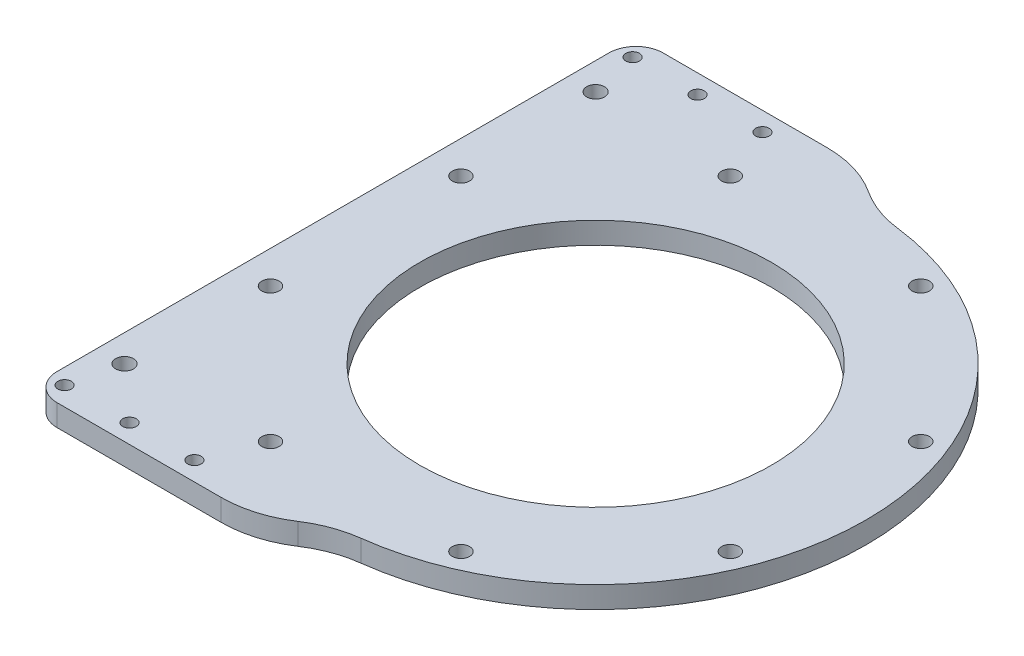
ISO-10303-21;
HEADER;
FILE_DESCRIPTION(('STEP AP214'),'2;1');
FILE_NAME('part.step','',(''),(''),'','','');
FILE_SCHEMA(('AUTOMOTIVE_DESIGN { 1 0 10303 214 1 1 1 1 }'));
ENDSEC;
DATA;
#1=APPLICATION_CONTEXT('core data for automotive mechanical design processes');
#2=APPLICATION_PROTOCOL_DEFINITION('international standard','automotive_design',2000,#1);
#3=PRODUCT_CONTEXT('',#1,'mechanical');
#4=PRODUCT('Part','Part','',(#3));
#5=PRODUCT_RELATED_PRODUCT_CATEGORY('part','',(#4));
#6=PRODUCT_DEFINITION_FORMATION('','',#4);
#7=PRODUCT_DEFINITION_CONTEXT('part definition',#1,'design');
#8=PRODUCT_DEFINITION('design','',#6,#7);
#9=PRODUCT_DEFINITION_SHAPE('','',#8);
#10=(LENGTH_UNIT() NAMED_UNIT(*) SI_UNIT(.MILLI.,.METRE.));
#11=(NAMED_UNIT(*) PLANE_ANGLE_UNIT() SI_UNIT($,.RADIAN.));
#12=(NAMED_UNIT(*) SI_UNIT($,.STERADIAN.) SOLID_ANGLE_UNIT());
#13=UNCERTAINTY_MEASURE_WITH_UNIT(LENGTH_MEASURE(1.E-05),#10,'distance_accuracy_value','');
#14=(GEOMETRIC_REPRESENTATION_CONTEXT(3) GLOBAL_UNCERTAINTY_ASSIGNED_CONTEXT((#13)) GLOBAL_UNIT_ASSIGNED_CONTEXT((#10,
#11,#12)) REPRESENTATION_CONTEXT('',''));
#15=CARTESIAN_POINT('',(0.,0.,0.));
#16=DIRECTION('',(0.,0.,1.));
#17=DIRECTION('',(1.,0.,0.));
#18=AXIS2_PLACEMENT_3D('',#15,#16,#17);
#19=CARTESIAN_POINT('',(-100.,3.,56.));
#20=DIRECTION('',(0.,0.,1.));
#21=DIRECTION('',(1.,0.,0.));
#22=AXIS2_PLACEMENT_3D('',#19,#20,#21);
#23=PLANE('',#22);
#24=DIRECTION('',(1.,0.,0.));
#25=VECTOR('',#24,1.);
#26=CARTESIAN_POINT('',(-100.,3.,56.));
#27=LINE('',#26,#25);
#28=CARTESIAN_POINT('',(113.400785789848,3.,56.));
#29=VERTEX_POINT('',#28);
#30=CARTESIAN_POINT('',(143.705644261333,3.,56.));
#31=VERTEX_POINT('',#30);
#32=EDGE_CURVE('E126',#29,#31,#27,.T.);
#33=ORIENTED_EDGE('',*,*,#32,.F.);
#34=DIRECTION('',(0.,1.,0.));
#35=VECTOR('',#34,1.);
#36=CARTESIAN_POINT('',(113.400785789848,-1.,56.));
#37=LINE('',#36,#35);
#38=CARTESIAN_POINT('',(113.400785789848,-1.,56.));
#39=VERTEX_POINT('',#38);
#40=EDGE_CURVE('E70',#29,#39,#37,.F.);
#41=ORIENTED_EDGE('',*,*,#40,.T.);
#42=DIRECTION('',(1.,0.,0.));
#43=VECTOR('',#42,1.);
#44=CARTESIAN_POINT('',(0.,-1.,56.));
#45=LINE('',#44,#43);
#46=CARTESIAN_POINT('',(143.705644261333,-1.,56.));
#47=VERTEX_POINT('',#46);
#48=EDGE_CURVE('E140',#39,#47,#45,.T.);
#49=ORIENTED_EDGE('',*,*,#48,.T.);
#50=DIRECTION('',(0.,1.,0.));
#51=VECTOR('',#50,1.);
#52=CARTESIAN_POINT('',(143.705644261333,3.,56.));
#53=LINE('',#52,#51);
#54=EDGE_CURVE('E139',#47,#31,#53,.T.);
#55=ORIENTED_EDGE('',*,*,#54,.T.);
#56=EDGE_LOOP('',(#33,#41,#49,#55));
#57=FACE_BOUND('',#56,.T.);
#58=ADVANCED_FACE('F47',(#57),#23,.T.);
#59=CARTESIAN_POINT('',(143.705644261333,3.,36.));
#60=DIRECTION('',(0.,1.,0.));
#61=DIRECTION('',(0.,0.,1.));
#62=AXIS2_PLACEMENT_3D('',#59,#60,#61);
#63=CYLINDRICAL_SURFACE('',#62,20.);
#64=ORIENTED_EDGE('',*,*,#54,.F.);
#65=CARTESIAN_POINT('',(143.705644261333,-1.,36.));
#66=DIRECTION('',(0.,1.,0.));
#67=DIRECTION('',(0.,0.,1.));
#68=AXIS2_PLACEMENT_3D('',#65,#66,#67);
#69=CIRCLE('',#68,20.);
#70=CARTESIAN_POINT('',(154.665979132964,-1.,52.7293472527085));
#71=VERTEX_POINT('',#70);
#72=EDGE_CURVE('E233',#47,#71,#69,.T.);
#73=ORIENTED_EDGE('',*,*,#72,.T.);
#74=DIRECTION('',(0.,1.,0.));
#75=VECTOR('',#74,1.);
#76=CARTESIAN_POINT('',(154.665979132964,3.,52.7293472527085));
#77=LINE('',#76,#75);
#78=CARTESIAN_POINT('',(154.665979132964,3.,52.7293472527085));
#79=VERTEX_POINT('',#78);
#80=EDGE_CURVE('E145',#71,#79,#77,.T.);
#81=ORIENTED_EDGE('',*,*,#80,.T.);
#82=CARTESIAN_POINT('',(143.705644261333,3.,36.));
#83=DIRECTION('',(0.,1.,0.));
#84=DIRECTION('',(0.,0.,1.));
#85=AXIS2_PLACEMENT_3D('',#82,#83,#84);
#86=CIRCLE('',#85,20.);
#87=EDGE_CURVE('E133',#31,#79,#86,.T.);
#88=ORIENTED_EDGE('',*,*,#87,.F.);
#89=EDGE_LOOP('',(#64,#73,#81,#88));
#90=FACE_BOUND('',#89,.T.);
#91=ADVANCED_FACE('F147',(#90),#63,.T.);
#92=CARTESIAN_POINT('',(165.626314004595,3.,69.458694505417));
#93=DIRECTION('',(0.,1.,0.));
#94=DIRECTION('',(0.,0.,1.));
#95=AXIS2_PLACEMENT_3D('',#92,#93,#94);
#96=CYLINDRICAL_SURFACE('',#95,20.);
#97=ORIENTED_EDGE('',*,*,#80,.F.);
#98=CARTESIAN_POINT('',(165.626314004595,-1.,69.458694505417));
#99=DIRECTION('',(0.,1.,0.));
#100=DIRECTION('',(0.,0.,1.));
#101=AXIS2_PLACEMENT_3D('',#98,#99,#100);
#102=CIRCLE('',#101,20.);
#103=CARTESIAN_POINT('',(163.14388994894,-1.,49.613353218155));
#104=VERTEX_POINT('',#103);
#105=EDGE_CURVE('E230',#71,#104,#102,.F.);
#106=ORIENTED_EDGE('',*,*,#105,.T.);
#107=DIRECTION('',(0.,1.,0.));
#108=VECTOR('',#107,1.);
#109=CARTESIAN_POINT('',(163.14388994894,3.,49.613353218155));
#110=LINE('',#109,#108);
#111=CARTESIAN_POINT('',(163.14388994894,3.,49.613353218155));
#112=VERTEX_POINT('',#111);
#113=EDGE_CURVE('E241',#104,#112,#110,.T.);
#114=ORIENTED_EDGE('',*,*,#113,.T.);
#115=CARTESIAN_POINT('',(165.626314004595,3.,69.458694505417));
#116=DIRECTION('',(0.,1.,0.));
#117=DIRECTION('',(0.,0.,1.));
#118=AXIS2_PLACEMENT_3D('',#115,#116,#117);
#119=CIRCLE('',#118,20.);
#120=EDGE_CURVE('E148',#79,#112,#119,.F.);
#121=ORIENTED_EDGE('',*,*,#120,.F.);
#122=EDGE_LOOP('',(#97,#106,#114,#121));
#123=FACE_BOUND('',#122,.T.);
#124=ADVANCED_FACE('F278',(#123),#96,.F.);
#125=CARTESIAN_POINT('',(156.937829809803,3.,0.));
#126=DIRECTION('',(0.,1.,0.));
#127=DIRECTION('',(0.,0.,1.));
#128=AXIS2_PLACEMENT_3D('',#125,#126,#127);
#129=CYLINDRICAL_SURFACE('',#128,50.);
#130=ORIENTED_EDGE('',*,*,#113,.F.);
#131=CARTESIAN_POINT('',(156.937829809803,-1.,0.));
#132=DIRECTION('',(0.,1.,0.));
#133=DIRECTION('',(0.,0.,1.));
#134=AXIS2_PLACEMENT_3D('',#131,#132,#133);
#135=CIRCLE('',#134,50.);
#136=CARTESIAN_POINT('',(163.14388994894,-1.,-49.613353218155));
#137=VERTEX_POINT('',#136);
#138=EDGE_CURVE('E227',#104,#137,#135,.T.);
#139=ORIENTED_EDGE('',*,*,#138,.T.);
#140=DIRECTION('',(0.,1.,0.));
#141=VECTOR('',#140,1.);
#142=CARTESIAN_POINT('',(163.14388994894,3.,-49.613353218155));
#143=LINE('',#142,#141);
#144=CARTESIAN_POINT('',(163.14388994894,3.,-49.613353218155));
#145=VERTEX_POINT('',#144);
#146=EDGE_CURVE('E239',#137,#145,#143,.T.);
#147=ORIENTED_EDGE('',*,*,#146,.T.);
#148=CARTESIAN_POINT('',(156.937829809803,3.,0.));
#149=DIRECTION('',(0.,1.,0.));
#150=DIRECTION('',(0.,0.,1.));
#151=AXIS2_PLACEMENT_3D('',#148,#149,#150);
#152=CIRCLE('',#151,50.);
#153=EDGE_CURVE('E150',#112,#145,#152,.T.);
#154=ORIENTED_EDGE('',*,*,#153,.F.);
#155=EDGE_LOOP('',(#130,#139,#147,#154));
#156=FACE_BOUND('',#155,.T.);
#157=ADVANCED_FACE('F283',(#156),#129,.T.);
#158=CARTESIAN_POINT('',(165.626314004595,3.,-69.458694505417));
#159=DIRECTION('',(0.,1.,0.));
#160=DIRECTION('',(0.,0.,1.));
#161=AXIS2_PLACEMENT_3D('',#158,#159,#160);
#162=CYLINDRICAL_SURFACE('',#161,20.);
#163=ORIENTED_EDGE('',*,*,#146,.F.);
#164=CARTESIAN_POINT('',(165.626314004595,-1.,-69.458694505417));
#165=DIRECTION('',(0.,1.,0.));
#166=DIRECTION('',(0.,0.,1.));
#167=AXIS2_PLACEMENT_3D('',#164,#165,#166);
#168=CIRCLE('',#167,20.);
#169=CARTESIAN_POINT('',(154.665979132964,-1.,-52.7293472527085));
#170=VERTEX_POINT('',#169);
#171=EDGE_CURVE('E224',#137,#170,#168,.F.);
#172=ORIENTED_EDGE('',*,*,#171,.T.);
#173=DIRECTION('',(0.,1.,0.));
#174=VECTOR('',#173,1.);
#175=CARTESIAN_POINT('',(154.665979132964,3.,-52.7293472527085));
#176=LINE('',#175,#174);
#177=CARTESIAN_POINT('',(154.665979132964,3.,-52.7293472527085));
#178=VERTEX_POINT('',#177);
#179=EDGE_CURVE('E237',#170,#178,#176,.T.);
#180=ORIENTED_EDGE('',*,*,#179,.T.);
#181=CARTESIAN_POINT('',(165.626314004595,3.,-69.458694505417));
#182=DIRECTION('',(0.,1.,0.));
#183=DIRECTION('',(0.,0.,1.));
#184=AXIS2_PLACEMENT_3D('',#181,#182,#183);
#185=CIRCLE('',#184,20.);
#186=EDGE_CURVE('E156',#145,#178,#185,.F.);
#187=ORIENTED_EDGE('',*,*,#186,.F.);
#188=EDGE_LOOP('',(#163,#172,#180,#187));
#189=FACE_BOUND('',#188,.T.);
#190=ADVANCED_FACE('F287',(#189),#162,.F.);
#191=CARTESIAN_POINT('',(143.705644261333,3.,-36.));
#192=DIRECTION('',(0.,1.,0.));
#193=DIRECTION('',(0.,0.,1.));
#194=AXIS2_PLACEMENT_3D('',#191,#192,#193);
#195=CYLINDRICAL_SURFACE('',#194,20.);
#196=ORIENTED_EDGE('',*,*,#179,.F.);
#197=CARTESIAN_POINT('',(143.705644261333,-1.,-36.));
#198=DIRECTION('',(0.,1.,0.));
#199=DIRECTION('',(0.,0.,1.));
#200=AXIS2_PLACEMENT_3D('',#197,#198,#199);
#201=CIRCLE('',#200,20.);
#202=CARTESIAN_POINT('',(143.705644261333,-1.,-56.));
#203=VERTEX_POINT('',#202);
#204=EDGE_CURVE('E221',#170,#203,#201,.T.);
#205=ORIENTED_EDGE('',*,*,#204,.T.);
#206=DIRECTION('',(0.,1.,0.));
#207=VECTOR('',#206,1.);
#208=CARTESIAN_POINT('',(143.705644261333,3.,-56.));
#209=LINE('',#208,#207);
#210=CARTESIAN_POINT('',(143.705644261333,3.,-56.));
#211=VERTEX_POINT('',#210);
#212=EDGE_CURVE('E165',#203,#211,#209,.T.);
#213=ORIENTED_EDGE('',*,*,#212,.T.);
#214=CARTESIAN_POINT('',(143.705644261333,3.,-36.));
#215=DIRECTION('',(0.,1.,0.));
#216=DIRECTION('',(0.,0.,1.));
#217=AXIS2_PLACEMENT_3D('',#214,#215,#216);
#218=CIRCLE('',#217,20.);
#219=EDGE_CURVE('E159',#178,#211,#218,.T.);
#220=ORIENTED_EDGE('',*,*,#219,.F.);
#221=EDGE_LOOP('',(#196,#205,#213,#220));
#222=FACE_BOUND('',#221,.T.);
#223=ADVANCED_FACE('F291',(#222),#195,.T.);
#224=CARTESIAN_POINT('',(-100.,3.,-56.));
#225=DIRECTION('',(0.,0.,-1.));
#226=DIRECTION('',(-1.,0.,0.));
#227=AXIS2_PLACEMENT_3D('',#224,#225,#226);
#228=PLANE('',#227);
#229=DIRECTION('',(1.,0.,0.));
#230=VECTOR('',#229,1.);
#231=CARTESIAN_POINT('',(0.,-1.,-56.));
#232=LINE('',#231,#230);
#233=CARTESIAN_POINT('',(113.400785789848,-1.,-56.));
#234=VERTEX_POINT('',#233);
#235=EDGE_CURVE('E218',#203,#234,#232,.F.);
#236=ORIENTED_EDGE('',*,*,#235,.T.);
#237=DIRECTION('',(0.,1.,0.));
#238=VECTOR('',#237,1.);
#239=CARTESIAN_POINT('',(113.400785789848,3.,-56.));
#240=LINE('',#239,#238);
#241=CARTESIAN_POINT('',(113.400785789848,3.,-56.));
#242=VERTEX_POINT('',#241);
#243=EDGE_CURVE('E11',#234,#242,#240,.T.);
#244=ORIENTED_EDGE('',*,*,#243,.T.);
#245=DIRECTION('',(-1.,0.,0.));
#246=VECTOR('',#245,1.);
#247=CARTESIAN_POINT('',(-100.,3.,-56.));
#248=LINE('',#247,#246);
#249=EDGE_CURVE('E162',#211,#242,#248,.T.);
#250=ORIENTED_EDGE('',*,*,#249,.F.);
#251=ORIENTED_EDGE('',*,*,#212,.F.);
#252=EDGE_LOOP('',(#236,#244,#250,#251));
#253=FACE_BOUND('',#252,.T.);
#254=ADVANCED_FACE('F295',(#253),#228,.T.);
#255=CARTESIAN_POINT('',(135.277829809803,3.,52.5));
#256=DIRECTION('',(0.,1.,0.));
#257=DIRECTION('',(0.,0.,1.));
#258=AXIS2_PLACEMENT_3D('',#255,#256,#257);
#259=CYLINDRICAL_SURFACE('',#258,1.25000000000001);
#260=CARTESIAN_POINT('',(135.277829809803,3.,52.5));
#261=DIRECTION('',(0.,1.,0.));
#262=DIRECTION('',(0.,0.,1.));
#263=AXIS2_PLACEMENT_3D('',#260,#261,#262);
#264=CIRCLE('',#263,1.25000000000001);
#265=CARTESIAN_POINT('',(135.277829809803,3.,53.75));
#266=VERTEX_POINT('',#265);
#267=EDGE_CURVE('E220',#266,#266,#264,.F.);
#268=ORIENTED_EDGE('',*,*,#267,.F.);
#269=EDGE_LOOP('',(#268));
#270=FACE_BOUND('',#269,.T.);
#271=CARTESIAN_POINT('',(135.277829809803,-1.,52.5));
#272=DIRECTION('',(0.,1.,0.));
#273=DIRECTION('',(0.,0.,1.));
#274=AXIS2_PLACEMENT_3D('',#271,#272,#273);
#275=CIRCLE('',#274,1.25000000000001);
#276=CARTESIAN_POINT('',(135.277829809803,-1.,53.75));
#277=VERTEX_POINT('',#276);
#278=EDGE_CURVE('E166',#277,#277,#275,.F.);
#279=ORIENTED_EDGE('',*,*,#278,.T.);
#280=EDGE_LOOP('',(#279));
#281=FACE_BOUND('',#280,.T.);
#282=ADVANCED_FACE('F298',(#270,#281),#259,.F.);
#283=CARTESIAN_POINT('',(123.277829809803,3.,52.4999999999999));
#284=DIRECTION('',(0.,1.,0.));
#285=DIRECTION('',(0.,0.,1.));
#286=AXIS2_PLACEMENT_3D('',#283,#284,#285);
#287=CYLINDRICAL_SURFACE('',#286,1.25);
#288=CARTESIAN_POINT('',(123.277829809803,3.,52.4999999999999));
#289=DIRECTION('',(0.,1.,0.));
#290=DIRECTION('',(0.,0.,1.));
#291=AXIS2_PLACEMENT_3D('',#288,#289,#290);
#292=CIRCLE('',#291,1.25);
#293=CARTESIAN_POINT('',(123.277829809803,3.,53.7499999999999));
#294=VERTEX_POINT('',#293);
#295=EDGE_CURVE('E718',#294,#294,#292,.F.);
#296=ORIENTED_EDGE('',*,*,#295,.F.);
#297=EDGE_LOOP('',(#296));
#298=FACE_BOUND('',#297,.T.);
#299=CARTESIAN_POINT('',(123.277829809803,-1.,52.4999999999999));
#300=DIRECTION('',(0.,1.,0.));
#301=DIRECTION('',(0.,0.,1.));
#302=AXIS2_PLACEMENT_3D('',#299,#300,#301);
#303=CIRCLE('',#302,1.25);
#304=CARTESIAN_POINT('',(123.277829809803,-1.,53.7499999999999));
#305=VERTEX_POINT('',#304);
#306=EDGE_CURVE('E169',#305,#305,#303,.F.);
#307=ORIENTED_EDGE('',*,*,#306,.T.);
#308=EDGE_LOOP('',(#307));
#309=FACE_BOUND('',#308,.T.);
#310=ADVANCED_FACE('F358',(#298,#309),#287,.F.);
#311=CARTESIAN_POINT('',(111.277829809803,3.,52.4999999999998));
#312=DIRECTION('',(0.,1.,0.));
#313=DIRECTION('',(0.,0.,1.));
#314=AXIS2_PLACEMENT_3D('',#311,#312,#313);
#315=CYLINDRICAL_SURFACE('',#314,1.25);
#316=CARTESIAN_POINT('',(111.277829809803,3.,52.4999999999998));
#317=DIRECTION('',(0.,1.,0.));
#318=DIRECTION('',(0.,0.,1.));
#319=AXIS2_PLACEMENT_3D('',#316,#317,#318);
#320=CIRCLE('',#319,1.25);
#321=CARTESIAN_POINT('',(111.277829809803,3.,53.7499999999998));
#322=VERTEX_POINT('',#321);
#323=EDGE_CURVE('E721',#322,#322,#320,.F.);
#324=ORIENTED_EDGE('',*,*,#323,.F.);
#325=EDGE_LOOP('',(#324));
#326=FACE_BOUND('',#325,.T.);
#327=CARTESIAN_POINT('',(111.277829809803,-1.,52.4999999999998));
#328=DIRECTION('',(0.,1.,0.));
#329=DIRECTION('',(0.,0.,1.));
#330=AXIS2_PLACEMENT_3D('',#327,#328,#329);
#331=CIRCLE('',#330,1.25);
#332=CARTESIAN_POINT('',(111.277829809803,-1.,53.7499999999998));
#333=VERTEX_POINT('',#332);
#334=EDGE_CURVE('E173',#333,#333,#331,.F.);
#335=ORIENTED_EDGE('',*,*,#334,.T.);
#336=EDGE_LOOP('',(#335));
#337=FACE_BOUND('',#336,.T.);
#338=ADVANCED_FACE('F354',(#326,#337),#315,.F.);
#339=CARTESIAN_POINT('',(156.937829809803,3.,0.));
#340=DIRECTION('',(0.,1.,0.));
#341=DIRECTION('',(0.,0.,1.));
#342=AXIS2_PLACEMENT_3D('',#339,#340,#341);
#343=CYLINDRICAL_SURFACE('',#342,32.5);
#344=CARTESIAN_POINT('',(156.937829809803,3.,0.));
#345=DIRECTION('',(0.,1.,0.));
#346=DIRECTION('',(0.,0.,1.));
#347=AXIS2_PLACEMENT_3D('',#344,#345,#346);
#348=CIRCLE('',#347,32.5);
#349=CARTESIAN_POINT('',(156.937829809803,3.,32.5));
#350=VERTEX_POINT('',#349);
#351=EDGE_CURVE('E727',#350,#350,#348,.T.);
#352=ORIENTED_EDGE('',*,*,#351,.T.);
#353=EDGE_LOOP('',(#352));
#354=FACE_BOUND('',#353,.T.);
#355=CARTESIAN_POINT('',(156.937829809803,-1.,0.));
#356=DIRECTION('',(0.,1.,0.));
#357=DIRECTION('',(0.,0.,1.));
#358=AXIS2_PLACEMENT_3D('',#355,#356,#357);
#359=CIRCLE('',#358,32.5);
#360=CARTESIAN_POINT('',(156.937829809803,-1.,32.5));
#361=VERTEX_POINT('',#360);
#362=EDGE_CURVE('E176',#361,#361,#359,.T.);
#363=ORIENTED_EDGE('',*,*,#362,.F.);
#364=EDGE_LOOP('',(#363));
#365=FACE_BOUND('',#364,.T.);
#366=ADVANCED_FACE('F350',(#354,#365),#343,.F.);
#367=CARTESIAN_POINT('',(113.400785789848,3.,43.5370440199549));
#368=DIRECTION('',(0.,1.,0.));
#369=DIRECTION('',(0.,0.,1.));
#370=AXIS2_PLACEMENT_3D('',#367,#368,#369);
#371=CYLINDRICAL_SURFACE('',#370,1.65);
#372=CARTESIAN_POINT('',(113.400785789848,3.,43.5370440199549));
#373=DIRECTION('',(0.,1.,0.));
#374=DIRECTION('',(0.,0.,1.));
#375=AXIS2_PLACEMENT_3D('',#372,#373,#374);
#376=CIRCLE('',#375,1.65);
#377=CARTESIAN_POINT('',(113.400785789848,3.,45.1870440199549));
#378=VERTEX_POINT('',#377);
#379=EDGE_CURVE('E730',#378,#378,#376,.F.);
#380=ORIENTED_EDGE('',*,*,#379,.F.);
#381=EDGE_LOOP('',(#380));
#382=FACE_BOUND('',#381,.T.);
#383=CARTESIAN_POINT('',(113.400785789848,-1.,43.5370440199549));
#384=DIRECTION('',(0.,1.,0.));
#385=DIRECTION('',(0.,0.,1.));
#386=AXIS2_PLACEMENT_3D('',#383,#384,#385);
#387=CIRCLE('',#386,1.65);
#388=CARTESIAN_POINT('',(113.400785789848,-1.,45.1870440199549));
#389=VERTEX_POINT('',#388);
#390=EDGE_CURVE('E179',#389,#389,#387,.F.);
#391=ORIENTED_EDGE('',*,*,#390,.T.);
#392=EDGE_LOOP('',(#391));
#393=FACE_BOUND('',#392,.T.);
#394=ADVANCED_FACE('F346',(#382,#393),#371,.F.);
#395=CARTESIAN_POINT('',(139.335954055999,3.,42.4991055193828));
#396=DIRECTION('',(0.,1.,0.));
#397=DIRECTION('',(0.,0.,1.));
#398=AXIS2_PLACEMENT_3D('',#395,#396,#397);
#399=CYLINDRICAL_SURFACE('',#398,1.59999999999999);
#400=CARTESIAN_POINT('',(139.335954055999,3.,42.4991055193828));
#401=DIRECTION('',(0.,1.,0.));
#402=DIRECTION('',(0.,0.,1.));
#403=AXIS2_PLACEMENT_3D('',#400,#401,#402);
#404=CIRCLE('',#403,1.59999999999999);
#405=CARTESIAN_POINT('',(139.335954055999,3.,44.0991055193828));
#406=VERTEX_POINT('',#405);
#407=EDGE_CURVE('E733',#406,#406,#404,.T.);
#408=ORIENTED_EDGE('',*,*,#407,.T.);
#409=EDGE_LOOP('',(#408));
#410=FACE_BOUND('',#409,.T.);
#411=CARTESIAN_POINT('',(139.335954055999,-1.,42.4991055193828));
#412=DIRECTION('',(0.,1.,0.));
#413=DIRECTION('',(0.,0.,1.));
#414=AXIS2_PLACEMENT_3D('',#411,#412,#413);
#415=CIRCLE('',#414,1.59999999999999);
#416=CARTESIAN_POINT('',(139.335954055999,-1.,44.0991055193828));
#417=VERTEX_POINT('',#416);
#418=EDGE_CURVE('E182',#417,#417,#415,.T.);
#419=ORIENTED_EDGE('',*,*,#418,.F.);
#420=EDGE_LOOP('',(#419));
#421=FACE_BOUND('',#420,.T.);
#422=ADVANCED_FACE('F342',(#410,#421),#399,.F.);
#423=CARTESIAN_POINT('',(174.539705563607,3.,-42.4991055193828));
#424=DIRECTION('',(0.,1.,0.));
#425=DIRECTION('',(0.,0.,1.));
#426=AXIS2_PLACEMENT_3D('',#423,#424,#425);
#427=CYLINDRICAL_SURFACE('',#426,1.59999999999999);
#428=CARTESIAN_POINT('',(174.539705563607,3.,-42.4991055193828));
#429=DIRECTION('',(0.,1.,0.));
#430=DIRECTION('',(0.,0.,1.));
#431=AXIS2_PLACEMENT_3D('',#428,#429,#430);
#432=CIRCLE('',#431,1.59999999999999);
#433=CARTESIAN_POINT('',(174.539705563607,3.,-40.8991055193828));
#434=VERTEX_POINT('',#433);
#435=EDGE_CURVE('E736',#434,#434,#432,.T.);
#436=ORIENTED_EDGE('',*,*,#435,.T.);
#437=EDGE_LOOP('',(#436));
#438=FACE_BOUND('',#437,.T.);
#439=CARTESIAN_POINT('',(174.539705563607,-1.,-42.4991055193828));
#440=DIRECTION('',(0.,1.,0.));
#441=DIRECTION('',(0.,0.,1.));
#442=AXIS2_PLACEMENT_3D('',#439,#440,#441);
#443=CIRCLE('',#442,1.59999999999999);
#444=CARTESIAN_POINT('',(174.539705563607,-1.,-40.8991055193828));
#445=VERTEX_POINT('',#444);
#446=EDGE_CURVE('E185',#445,#445,#443,.T.);
#447=ORIENTED_EDGE('',*,*,#446,.F.);
#448=EDGE_LOOP('',(#447));
#449=FACE_BOUND('',#448,.T.);
#450=ADVANCED_FACE('F338',(#438,#449),#427,.F.);
#451=CARTESIAN_POINT('',(139.332829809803,3.,-42.4978114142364));
#452=DIRECTION('',(0.,1.,0.));
#453=DIRECTION('',(0.,0.,1.));
#454=AXIS2_PLACEMENT_3D('',#451,#452,#453);
#455=CYLINDRICAL_SURFACE('',#454,1.59999999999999);
#456=CARTESIAN_POINT('',(139.332829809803,3.,-42.4978114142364));
#457=DIRECTION('',(0.,1.,0.));
#458=DIRECTION('',(0.,0.,1.));
#459=AXIS2_PLACEMENT_3D('',#456,#457,#458);
#460=CIRCLE('',#459,1.59999999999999);
#461=CARTESIAN_POINT('',(139.332829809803,3.,-40.8978114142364));
#462=VERTEX_POINT('',#461);
#463=EDGE_CURVE('E739',#462,#462,#460,.T.);
#464=ORIENTED_EDGE('',*,*,#463,.T.);
#465=EDGE_LOOP('',(#464));
#466=FACE_BOUND('',#465,.T.);
#467=CARTESIAN_POINT('',(139.332829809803,-1.,-42.4978114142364));
#468=DIRECTION('',(0.,1.,0.));
#469=DIRECTION('',(0.,0.,1.));
#470=AXIS2_PLACEMENT_3D('',#467,#468,#469);
#471=CIRCLE('',#470,1.59999999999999);
#472=CARTESIAN_POINT('',(139.332829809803,-1.,-40.8978114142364));
#473=VERTEX_POINT('',#472);
#474=EDGE_CURVE('E188',#473,#473,#471,.T.);
#475=ORIENTED_EDGE('',*,*,#474,.F.);
#476=EDGE_LOOP('',(#475));
#477=FACE_BOUND('',#476,.T.);
#478=ADVANCED_FACE('F334',(#466,#477),#455,.F.);
#479=CARTESIAN_POINT('',(114.43872429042,3.,-17.6018757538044));
#480=DIRECTION('',(0.,1.,0.));
#481=DIRECTION('',(0.,0.,1.));
#482=AXIS2_PLACEMENT_3D('',#479,#480,#481);
#483=CYLINDRICAL_SURFACE('',#482,1.6);
#484=CARTESIAN_POINT('',(114.43872429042,3.,-17.6018757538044));
#485=DIRECTION('',(0.,1.,0.));
#486=DIRECTION('',(0.,0.,1.));
#487=AXIS2_PLACEMENT_3D('',#484,#485,#486);
#488=CIRCLE('',#487,1.6);
#489=CARTESIAN_POINT('',(114.43872429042,3.,-16.0018757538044));
#490=VERTEX_POINT('',#489);
#491=EDGE_CURVE('E742',#490,#490,#488,.T.);
#492=ORIENTED_EDGE('',*,*,#491,.T.);
#493=EDGE_LOOP('',(#492));
#494=FACE_BOUND('',#493,.T.);
#495=CARTESIAN_POINT('',(114.43872429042,-1.,-17.6018757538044));
#496=DIRECTION('',(0.,1.,0.));
#497=DIRECTION('',(0.,0.,1.));
#498=AXIS2_PLACEMENT_3D('',#495,#496,#497);
#499=CIRCLE('',#498,1.6);
#500=CARTESIAN_POINT('',(114.43872429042,-1.,-16.0018757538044));
#501=VERTEX_POINT('',#500);
#502=EDGE_CURVE('E191',#501,#501,#499,.T.);
#503=ORIENTED_EDGE('',*,*,#502,.F.);
#504=EDGE_LOOP('',(#503));
#505=FACE_BOUND('',#504,.T.);
#506=ADVANCED_FACE('F330',(#494,#505),#483,.F.);
#507=CARTESIAN_POINT('',(174.542829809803,3.,42.4978114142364));
#508=DIRECTION('',(0.,1.,0.));
#509=DIRECTION('',(0.,0.,1.));
#510=AXIS2_PLACEMENT_3D('',#507,#508,#509);
#511=CYLINDRICAL_SURFACE('',#510,1.59999999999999);
#512=CARTESIAN_POINT('',(174.542829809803,3.,42.4978114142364));
#513=DIRECTION('',(0.,1.,0.));
#514=DIRECTION('',(0.,0.,1.));
#515=AXIS2_PLACEMENT_3D('',#512,#513,#514);
#516=CIRCLE('',#515,1.59999999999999);
#517=CARTESIAN_POINT('',(174.542829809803,3.,44.0978114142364));
#518=VERTEX_POINT('',#517);
#519=EDGE_CURVE('E745',#518,#518,#516,.T.);
#520=ORIENTED_EDGE('',*,*,#519,.T.);
#521=EDGE_LOOP('',(#520));
#522=FACE_BOUND('',#521,.T.);
#523=CARTESIAN_POINT('',(174.542829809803,-1.,42.4978114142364));
#524=DIRECTION('',(0.,1.,0.));
#525=DIRECTION('',(0.,0.,1.));
#526=AXIS2_PLACEMENT_3D('',#523,#524,#525);
#527=CIRCLE('',#526,1.59999999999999);
#528=CARTESIAN_POINT('',(174.542829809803,-1.,44.0978114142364));
#529=VERTEX_POINT('',#528);
#530=EDGE_CURVE('E194',#529,#529,#527,.T.);
#531=ORIENTED_EDGE('',*,*,#530,.F.);
#532=EDGE_LOOP('',(#531));
#533=FACE_BOUND('',#532,.T.);
#534=ADVANCED_FACE('F326',(#522,#533),#511,.F.);
#535=CARTESIAN_POINT('',(199.436935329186,3.,17.6018757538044));
#536=DIRECTION('',(0.,1.,0.));
#537=DIRECTION('',(0.,0.,1.));
#538=AXIS2_PLACEMENT_3D('',#535,#536,#537);
#539=CYLINDRICAL_SURFACE('',#538,1.59999999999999);
#540=CARTESIAN_POINT('',(199.436935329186,3.,17.6018757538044));
#541=DIRECTION('',(0.,1.,0.));
#542=DIRECTION('',(0.,0.,1.));
#543=AXIS2_PLACEMENT_3D('',#540,#541,#542);
#544=CIRCLE('',#543,1.59999999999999);
#545=CARTESIAN_POINT('',(199.436935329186,3.,19.2018757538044));
#546=VERTEX_POINT('',#545);
#547=EDGE_CURVE('E748',#546,#546,#544,.T.);
#548=ORIENTED_EDGE('',*,*,#547,.T.);
#549=EDGE_LOOP('',(#548));
#550=FACE_BOUND('',#549,.T.);
#551=CARTESIAN_POINT('',(199.436935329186,-1.,17.6018757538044));
#552=DIRECTION('',(0.,1.,0.));
#553=DIRECTION('',(0.,0.,1.));
#554=AXIS2_PLACEMENT_3D('',#551,#552,#553);
#555=CIRCLE('',#554,1.59999999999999);
#556=CARTESIAN_POINT('',(199.436935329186,-1.,19.2018757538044));
#557=VERTEX_POINT('',#556);
#558=EDGE_CURVE('E197',#557,#557,#555,.T.);
#559=ORIENTED_EDGE('',*,*,#558,.F.);
#560=EDGE_LOOP('',(#559));
#561=FACE_BOUND('',#560,.T.);
#562=ADVANCED_FACE('F322',(#550,#561),#539,.F.);
#563=CARTESIAN_POINT('',(199.43564122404,3.,-17.605));
#564=DIRECTION('',(0.,1.,0.));
#565=DIRECTION('',(0.,0.,1.));
#566=AXIS2_PLACEMENT_3D('',#563,#564,#565);
#567=CYLINDRICAL_SURFACE('',#566,1.59999999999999);
#568=CARTESIAN_POINT('',(199.43564122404,3.,-17.605));
#569=DIRECTION('',(0.,1.,0.));
#570=DIRECTION('',(0.,0.,1.));
#571=AXIS2_PLACEMENT_3D('',#568,#569,#570);
#572=CIRCLE('',#571,1.59999999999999);
#573=CARTESIAN_POINT('',(199.43564122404,3.,-16.005));
#574=VERTEX_POINT('',#573);
#575=EDGE_CURVE('E751',#574,#574,#572,.T.);
#576=ORIENTED_EDGE('',*,*,#575,.T.);
#577=EDGE_LOOP('',(#576));
#578=FACE_BOUND('',#577,.T.);
#579=CARTESIAN_POINT('',(199.43564122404,-1.,-17.605));
#580=DIRECTION('',(0.,1.,0.));
#581=DIRECTION('',(0.,0.,1.));
#582=AXIS2_PLACEMENT_3D('',#579,#580,#581);
#583=CIRCLE('',#582,1.59999999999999);
#584=CARTESIAN_POINT('',(199.43564122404,-1.,-16.005));
#585=VERTEX_POINT('',#584);
#586=EDGE_CURVE('E200',#585,#585,#583,.T.);
#587=ORIENTED_EDGE('',*,*,#586,.F.);
#588=EDGE_LOOP('',(#587));
#589=FACE_BOUND('',#588,.T.);
#590=ADVANCED_FACE('F318',(#578,#589),#567,.F.);
#591=CARTESIAN_POINT('',(114.440018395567,3.,17.605));
#592=DIRECTION('',(0.,1.,0.));
#593=DIRECTION('',(0.,0.,1.));
#594=AXIS2_PLACEMENT_3D('',#591,#592,#593);
#595=CYLINDRICAL_SURFACE('',#594,1.60000000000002);
#596=CARTESIAN_POINT('',(114.440018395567,3.,17.605));
#597=DIRECTION('',(0.,1.,0.));
#598=DIRECTION('',(0.,0.,1.));
#599=AXIS2_PLACEMENT_3D('',#596,#597,#598);
#600=CIRCLE('',#599,1.60000000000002);
#601=CARTESIAN_POINT('',(114.440018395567,3.,19.205));
#602=VERTEX_POINT('',#601);
#603=EDGE_CURVE('E754',#602,#602,#600,.T.);
#604=ORIENTED_EDGE('',*,*,#603,.T.);
#605=EDGE_LOOP('',(#604));
#606=FACE_BOUND('',#605,.T.);
#607=CARTESIAN_POINT('',(114.440018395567,-1.,17.605));
#608=DIRECTION('',(0.,1.,0.));
#609=DIRECTION('',(0.,0.,1.));
#610=AXIS2_PLACEMENT_3D('',#607,#608,#609);
#611=CIRCLE('',#610,1.60000000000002);
#612=CARTESIAN_POINT('',(114.440018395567,-1.,19.205));
#613=VERTEX_POINT('',#612);
#614=EDGE_CURVE('E203',#613,#613,#611,.T.);
#615=ORIENTED_EDGE('',*,*,#614,.F.);
#616=EDGE_LOOP('',(#615));
#617=FACE_BOUND('',#616,.T.);
#618=ADVANCED_FACE('F314',(#606,#617),#595,.F.);
#619=CARTESIAN_POINT('',(113.400785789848,3.,-43.5370440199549));
#620=DIRECTION('',(0.,1.,0.));
#621=DIRECTION('',(0.,0.,1.));
#622=AXIS2_PLACEMENT_3D('',#619,#620,#621);
#623=CYLINDRICAL_SURFACE('',#622,1.65);
#624=CARTESIAN_POINT('',(113.400785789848,3.,-43.5370440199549));
#625=DIRECTION('',(0.,1.,0.));
#626=DIRECTION('',(0.,0.,1.));
#627=AXIS2_PLACEMENT_3D('',#624,#625,#626);
#628=CIRCLE('',#627,1.65);
#629=CARTESIAN_POINT('',(113.400785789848,3.,-41.8870440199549));
#630=VERTEX_POINT('',#629);
#631=EDGE_CURVE('E757',#630,#630,#628,.T.);
#632=ORIENTED_EDGE('',*,*,#631,.T.);
#633=EDGE_LOOP('',(#632));
#634=FACE_BOUND('',#633,.T.);
#635=CARTESIAN_POINT('',(113.400785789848,-1.,-43.5370440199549));
#636=DIRECTION('',(0.,1.,0.));
#637=DIRECTION('',(0.,0.,1.));
#638=AXIS2_PLACEMENT_3D('',#635,#636,#637);
#639=CIRCLE('',#638,1.65);
#640=CARTESIAN_POINT('',(113.400785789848,-1.,-41.8870440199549));
#641=VERTEX_POINT('',#640);
#642=EDGE_CURVE('E206',#641,#641,#639,.T.);
#643=ORIENTED_EDGE('',*,*,#642,.F.);
#644=EDGE_LOOP('',(#643));
#645=FACE_BOUND('',#644,.T.);
#646=ADVANCED_FACE('F310',(#634,#645),#623,.F.);
#647=CARTESIAN_POINT('',(111.277829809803,3.,-52.4999999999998));
#648=DIRECTION('',(0.,1.,0.));
#649=DIRECTION('',(0.,0.,1.));
#650=AXIS2_PLACEMENT_3D('',#647,#648,#649);
#651=CYLINDRICAL_SURFACE('',#650,1.25);
#652=CARTESIAN_POINT('',(111.277829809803,3.,-52.4999999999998));
#653=DIRECTION('',(0.,1.,0.));
#654=DIRECTION('',(0.,0.,1.));
#655=AXIS2_PLACEMENT_3D('',#652,#653,#654);
#656=CIRCLE('',#655,1.25);
#657=CARTESIAN_POINT('',(111.277829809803,3.,-51.2499999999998));
#658=VERTEX_POINT('',#657);
#659=EDGE_CURVE('E760',#658,#658,#656,.T.);
#660=ORIENTED_EDGE('',*,*,#659,.T.);
#661=EDGE_LOOP('',(#660));
#662=FACE_BOUND('',#661,.T.);
#663=CARTESIAN_POINT('',(111.277829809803,-1.,-52.4999999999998));
#664=DIRECTION('',(0.,1.,0.));
#665=DIRECTION('',(0.,0.,1.));
#666=AXIS2_PLACEMENT_3D('',#663,#664,#665);
#667=CIRCLE('',#666,1.25);
#668=CARTESIAN_POINT('',(111.277829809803,-1.,-51.2499999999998));
#669=VERTEX_POINT('',#668);
#670=EDGE_CURVE('E209',#669,#669,#667,.T.);
#671=ORIENTED_EDGE('',*,*,#670,.F.);
#672=EDGE_LOOP('',(#671));
#673=FACE_BOUND('',#672,.T.);
#674=ADVANCED_FACE('F306',(#662,#673),#651,.F.);
#675=CARTESIAN_POINT('',(123.277829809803,3.,-52.4999999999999));
#676=DIRECTION('',(0.,1.,0.));
#677=DIRECTION('',(0.,0.,1.));
#678=AXIS2_PLACEMENT_3D('',#675,#676,#677);
#679=CYLINDRICAL_SURFACE('',#678,1.25);
#680=CARTESIAN_POINT('',(123.277829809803,3.,-52.4999999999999));
#681=DIRECTION('',(0.,1.,0.));
#682=DIRECTION('',(0.,0.,1.));
#683=AXIS2_PLACEMENT_3D('',#680,#681,#682);
#684=CIRCLE('',#683,1.25);
#685=CARTESIAN_POINT('',(123.277829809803,3.,-51.2499999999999));
#686=VERTEX_POINT('',#685);
#687=EDGE_CURVE('E763',#686,#686,#684,.T.);
#688=ORIENTED_EDGE('',*,*,#687,.T.);
#689=EDGE_LOOP('',(#688));
#690=FACE_BOUND('',#689,.T.);
#691=CARTESIAN_POINT('',(123.277829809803,-1.,-52.4999999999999));
#692=DIRECTION('',(0.,1.,0.));
#693=DIRECTION('',(0.,0.,1.));
#694=AXIS2_PLACEMENT_3D('',#691,#692,#693);
#695=CIRCLE('',#694,1.25);
#696=CARTESIAN_POINT('',(123.277829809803,-1.,-51.2499999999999));
#697=VERTEX_POINT('',#696);
#698=EDGE_CURVE('E212',#697,#697,#695,.T.);
#699=ORIENTED_EDGE('',*,*,#698,.F.);
#700=EDGE_LOOP('',(#699));
#701=FACE_BOUND('',#700,.T.);
#702=ADVANCED_FACE('F302',(#690,#701),#679,.F.);
#703=CARTESIAN_POINT('',(135.277829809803,3.,-52.5));
#704=DIRECTION('',(0.,1.,0.));
#705=DIRECTION('',(0.,0.,1.));
#706=AXIS2_PLACEMENT_3D('',#703,#704,#705);
#707=CYLINDRICAL_SURFACE('',#706,1.25000000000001);
#708=CARTESIAN_POINT('',(135.277829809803,3.,-52.5));
#709=DIRECTION('',(0.,1.,0.));
#710=DIRECTION('',(0.,0.,1.));
#711=AXIS2_PLACEMENT_3D('',#708,#709,#710);
#712=CIRCLE('',#711,1.25000000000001);
#713=CARTESIAN_POINT('',(135.277829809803,3.,-51.25));
#714=VERTEX_POINT('',#713);
#715=EDGE_CURVE('E136',#714,#714,#712,.T.);
#716=ORIENTED_EDGE('',*,*,#715,.T.);
#717=EDGE_LOOP('',(#716));
#718=FACE_BOUND('',#717,.T.);
#719=CARTESIAN_POINT('',(135.277829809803,-1.,-52.5));
#720=DIRECTION('',(0.,1.,0.));
#721=DIRECTION('',(0.,0.,1.));
#722=AXIS2_PLACEMENT_3D('',#719,#720,#721);
#723=CIRCLE('',#722,1.25000000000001);
#724=CARTESIAN_POINT('',(135.277829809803,-1.,-51.25));
#725=VERTEX_POINT('',#724);
#726=EDGE_CURVE('E215',#725,#725,#723,.T.);
#727=ORIENTED_EDGE('',*,*,#726,.F.);
#728=EDGE_LOOP('',(#727));
#729=FACE_BOUND('',#728,.T.);
#730=ADVANCED_FACE('F300',(#718,#729),#707,.F.);
#731=CARTESIAN_POINT('',(0.,3.,0.));
#732=DIRECTION('',(0.,1.,0.));
#733=DIRECTION('',(0.,0.,1.));
#734=AXIS2_PLACEMENT_3D('',#731,#732,#733);
#735=PLANE('',#734);
#736=DIRECTION('',(0.,0.,-1.));
#737=VECTOR('',#736,1.);
#738=CARTESIAN_POINT('',(108.400785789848,3.,0.));
#739=LINE('',#738,#737);
#740=CARTESIAN_POINT('',(108.400785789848,3.,51.));
#741=VERTEX_POINT('',#740);
#742=CARTESIAN_POINT('',(108.400785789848,3.,-51.));
#743=VERTEX_POINT('',#742);
#744=EDGE_CURVE('E170',#741,#743,#739,.T.);
#745=ORIENTED_EDGE('',*,*,#744,.F.);
#746=CARTESIAN_POINT('',(113.400785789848,3.,51.));
#747=DIRECTION('',(0.,1.,0.));
#748=DIRECTION('',(0.,0.,1.));
#749=AXIS2_PLACEMENT_3D('',#746,#747,#748);
#750=CIRCLE('',#749,5.);
#751=EDGE_CURVE('E135',#741,#29,#750,.T.);
#752=ORIENTED_EDGE('',*,*,#751,.T.);
#753=ORIENTED_EDGE('',*,*,#32,.T.);
#754=ORIENTED_EDGE('',*,*,#87,.T.);
#755=ORIENTED_EDGE('',*,*,#120,.T.);
#756=ORIENTED_EDGE('',*,*,#153,.T.);
#757=ORIENTED_EDGE('',*,*,#186,.T.);
#758=ORIENTED_EDGE('',*,*,#219,.T.);
#759=ORIENTED_EDGE('',*,*,#249,.T.);
#760=CARTESIAN_POINT('',(113.400785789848,3.,-51.));
#761=DIRECTION('',(0.,1.,0.));
#762=DIRECTION('',(0.,0.,1.));
#763=AXIS2_PLACEMENT_3D('',#760,#761,#762);
#764=CIRCLE('',#763,5.);
#765=EDGE_CURVE('E250',#242,#743,#764,.T.);
#766=ORIENTED_EDGE('',*,*,#765,.T.);
#767=EDGE_LOOP('',(#745,#752,#753,#754,#755,#756,#757,#758,#759,#766));
#768=FACE_BOUND('',#767,.T.);
#769=ORIENTED_EDGE('',*,*,#267,.T.);
#770=EDGE_LOOP('',(#769));
#771=FACE_BOUND('',#770,.T.);
#772=ORIENTED_EDGE('',*,*,#295,.T.);
#773=EDGE_LOOP('',(#772));
#774=FACE_BOUND('',#773,.T.);
#775=ORIENTED_EDGE('',*,*,#323,.T.);
#776=EDGE_LOOP('',(#775));
#777=FACE_BOUND('',#776,.T.);
#778=ORIENTED_EDGE('',*,*,#351,.F.);
#779=EDGE_LOOP('',(#778));
#780=FACE_BOUND('',#779,.T.);
#781=ORIENTED_EDGE('',*,*,#379,.T.);
#782=EDGE_LOOP('',(#781));
#783=FACE_BOUND('',#782,.T.);
#784=ORIENTED_EDGE('',*,*,#407,.F.);
#785=EDGE_LOOP('',(#784));
#786=FACE_BOUND('',#785,.T.);
#787=ORIENTED_EDGE('',*,*,#435,.F.);
#788=EDGE_LOOP('',(#787));
#789=FACE_BOUND('',#788,.T.);
#790=ORIENTED_EDGE('',*,*,#463,.F.);
#791=EDGE_LOOP('',(#790));
#792=FACE_BOUND('',#791,.T.);
#793=ORIENTED_EDGE('',*,*,#491,.F.);
#794=EDGE_LOOP('',(#793));
#795=FACE_BOUND('',#794,.T.);
#796=ORIENTED_EDGE('',*,*,#519,.F.);
#797=EDGE_LOOP('',(#796));
#798=FACE_BOUND('',#797,.T.);
#799=ORIENTED_EDGE('',*,*,#547,.F.);
#800=EDGE_LOOP('',(#799));
#801=FACE_BOUND('',#800,.T.);
#802=ORIENTED_EDGE('',*,*,#575,.F.);
#803=EDGE_LOOP('',(#802));
#804=FACE_BOUND('',#803,.T.);
#805=ORIENTED_EDGE('',*,*,#603,.F.);
#806=EDGE_LOOP('',(#805));
#807=FACE_BOUND('',#806,.T.);
#808=ORIENTED_EDGE('',*,*,#631,.F.);
#809=EDGE_LOOP('',(#808));
#810=FACE_BOUND('',#809,.T.);
#811=ORIENTED_EDGE('',*,*,#659,.F.);
#812=EDGE_LOOP('',(#811));
#813=FACE_BOUND('',#812,.T.);
#814=ORIENTED_EDGE('',*,*,#687,.F.);
#815=EDGE_LOOP('',(#814));
#816=FACE_BOUND('',#815,.T.);
#817=ORIENTED_EDGE('',*,*,#715,.F.);
#818=EDGE_LOOP('',(#817));
#819=FACE_BOUND('',#818,.T.);
#820=ADVANCED_FACE('F129',(#768,#771,#774,#777,#780,#783,#786,#789,#792,#795,#798,#801,#804,
#807,#810,#813,#816,#819),#735,.T.);
#821=CARTESIAN_POINT('',(0.,-1.,0.));
#822=DIRECTION('',(0.,1.,0.));
#823=DIRECTION('',(0.,0.,1.));
#824=AXIS2_PLACEMENT_3D('',#821,#822,#823);
#825=PLANE('',#824);
#826=ORIENTED_EDGE('',*,*,#278,.F.);
#827=EDGE_LOOP('',(#826));
#828=FACE_BOUND('',#827,.T.);
#829=ORIENTED_EDGE('',*,*,#306,.F.);
#830=EDGE_LOOP('',(#829));
#831=FACE_BOUND('',#830,.T.);
#832=ORIENTED_EDGE('',*,*,#334,.F.);
#833=EDGE_LOOP('',(#832));
#834=FACE_BOUND('',#833,.T.);
#835=ORIENTED_EDGE('',*,*,#362,.T.);
#836=EDGE_LOOP('',(#835));
#837=FACE_BOUND('',#836,.T.);
#838=ORIENTED_EDGE('',*,*,#390,.F.);
#839=EDGE_LOOP('',(#838));
#840=FACE_BOUND('',#839,.T.);
#841=ORIENTED_EDGE('',*,*,#418,.T.);
#842=EDGE_LOOP('',(#841));
#843=FACE_BOUND('',#842,.T.);
#844=ORIENTED_EDGE('',*,*,#446,.T.);
#845=EDGE_LOOP('',(#844));
#846=FACE_BOUND('',#845,.T.);
#847=ORIENTED_EDGE('',*,*,#474,.T.);
#848=EDGE_LOOP('',(#847));
#849=FACE_BOUND('',#848,.T.);
#850=ORIENTED_EDGE('',*,*,#502,.T.);
#851=EDGE_LOOP('',(#850));
#852=FACE_BOUND('',#851,.T.);
#853=ORIENTED_EDGE('',*,*,#530,.T.);
#854=EDGE_LOOP('',(#853));
#855=FACE_BOUND('',#854,.T.);
#856=ORIENTED_EDGE('',*,*,#558,.T.);
#857=EDGE_LOOP('',(#856));
#858=FACE_BOUND('',#857,.T.);
#859=ORIENTED_EDGE('',*,*,#586,.T.);
#860=EDGE_LOOP('',(#859));
#861=FACE_BOUND('',#860,.T.);
#862=ORIENTED_EDGE('',*,*,#614,.T.);
#863=EDGE_LOOP('',(#862));
#864=FACE_BOUND('',#863,.T.);
#865=ORIENTED_EDGE('',*,*,#642,.T.);
#866=EDGE_LOOP('',(#865));
#867=FACE_BOUND('',#866,.T.);
#868=ORIENTED_EDGE('',*,*,#670,.T.);
#869=EDGE_LOOP('',(#868));
#870=FACE_BOUND('',#869,.T.);
#871=ORIENTED_EDGE('',*,*,#698,.T.);
#872=EDGE_LOOP('',(#871));
#873=FACE_BOUND('',#872,.T.);
#874=ORIENTED_EDGE('',*,*,#726,.T.);
#875=EDGE_LOOP('',(#874));
#876=FACE_BOUND('',#875,.T.);
#877=ORIENTED_EDGE('',*,*,#48,.F.);
#878=CARTESIAN_POINT('',(113.400785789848,-1.,51.));
#879=DIRECTION('',(0.,1.,0.));
#880=DIRECTION('',(0.,0.,1.));
#881=AXIS2_PLACEMENT_3D('',#878,#879,#880);
#882=CIRCLE('',#881,5.);
#883=CARTESIAN_POINT('',(108.400785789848,-1.,51.));
#884=VERTEX_POINT('',#883);
#885=EDGE_CURVE('E55',#39,#884,#882,.F.);
#886=ORIENTED_EDGE('',*,*,#885,.T.);
#887=DIRECTION('',(0.,0.,-1.));
#888=VECTOR('',#887,1.);
#889=CARTESIAN_POINT('',(108.400785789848,-1.,0.));
#890=LINE('',#889,#888);
#891=CARTESIAN_POINT('',(108.400785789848,-1.,-51.));
#892=VERTEX_POINT('',#891);
#893=EDGE_CURVE('E144',#884,#892,#890,.T.);
#894=ORIENTED_EDGE('',*,*,#893,.T.);
#895=CARTESIAN_POINT('',(113.400785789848,-1.,-51.));
#896=DIRECTION('',(0.,1.,0.));
#897=DIRECTION('',(0.,0.,1.));
#898=AXIS2_PLACEMENT_3D('',#895,#896,#897);
#899=CIRCLE('',#898,5.);
#900=EDGE_CURVE('E62',#892,#234,#899,.F.);
#901=ORIENTED_EDGE('',*,*,#900,.T.);
#902=ORIENTED_EDGE('',*,*,#235,.F.);
#903=ORIENTED_EDGE('',*,*,#204,.F.);
#904=ORIENTED_EDGE('',*,*,#171,.F.);
#905=ORIENTED_EDGE('',*,*,#138,.F.);
#906=ORIENTED_EDGE('',*,*,#105,.F.);
#907=ORIENTED_EDGE('',*,*,#72,.F.);
#908=EDGE_LOOP('',(#877,#886,#894,#901,#902,#903,#904,#905,#906,#907));
#909=FACE_BOUND('',#908,.T.);
#910=ADVANCED_FACE('F256',(#828,#831,#834,#837,#840,#843,#846,#849,#852,#855,#858,#861,#864,
#867,#870,#873,#876,#909),#825,.F.);
#911=CARTESIAN_POINT('',(108.400785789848,-7.,0.));
#912=DIRECTION('',(1.,0.,0.));
#913=DIRECTION('',(0.,0.,-1.));
#914=AXIS2_PLACEMENT_3D('',#911,#912,#913);
#915=PLANE('',#914);
#916=ORIENTED_EDGE('',*,*,#893,.F.);
#917=DIRECTION('',(0.,1.,0.));
#918=VECTOR('',#917,1.);
#919=CARTESIAN_POINT('',(108.400785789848,3.,51.));
#920=LINE('',#919,#918);
#921=EDGE_CURVE('E247',#884,#741,#920,.T.);
#922=ORIENTED_EDGE('',*,*,#921,.T.);
#923=ORIENTED_EDGE('',*,*,#744,.T.);
#924=DIRECTION('',(0.,1.,0.));
#925=VECTOR('',#924,1.);
#926=CARTESIAN_POINT('',(108.400785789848,-1.,-51.));
#927=LINE('',#926,#925);
#928=EDGE_CURVE('E245',#743,#892,#927,.F.);
#929=ORIENTED_EDGE('',*,*,#928,.T.);
#930=EDGE_LOOP('',(#916,#922,#923,#929));
#931=FACE_BOUND('',#930,.T.);
#932=ADVANCED_FACE('F260',(#931),#915,.F.);
#933=CARTESIAN_POINT('',(113.400785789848,-7.,51.));
#934=DIRECTION('',(0.,-1.,0.));
#935=DIRECTION('',(0.,0.,-1.));
#936=AXIS2_PLACEMENT_3D('',#933,#934,#935);
#937=CYLINDRICAL_SURFACE('',#936,5.);
#938=ORIENTED_EDGE('',*,*,#885,.F.);
#939=ORIENTED_EDGE('',*,*,#40,.F.);
#940=ORIENTED_EDGE('',*,*,#751,.F.);
#941=ORIENTED_EDGE('',*,*,#921,.F.);
#942=EDGE_LOOP('',(#938,#939,#940,#941));
#943=FACE_BOUND('',#942,.T.);
#944=ADVANCED_FACE('F263',(#943),#937,.T.);
#945=CARTESIAN_POINT('',(113.400785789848,3.,-51.));
#946=DIRECTION('',(0.,-1.,0.));
#947=DIRECTION('',(0.,0.,-1.));
#948=AXIS2_PLACEMENT_3D('',#945,#946,#947);
#949=CYLINDRICAL_SURFACE('',#948,5.);
#950=ORIENTED_EDGE('',*,*,#900,.F.);
#951=ORIENTED_EDGE('',*,*,#928,.F.);
#952=ORIENTED_EDGE('',*,*,#765,.F.);
#953=ORIENTED_EDGE('',*,*,#243,.F.);
#954=EDGE_LOOP('',(#950,#951,#952,#953));
#955=FACE_BOUND('',#954,.T.);
#956=ADVANCED_FACE('F49',(#955),#949,.T.);
#957=CLOSED_SHELL('',(#58,#91,#124,#157,#190,#223,#254,#282,#310,#338,#366,#394,#422,#450,#478,
#506,#534,#562,#590,#618,#646,#674,#702,#730,#820,#910,#932,#944,#956));
#958=MANIFOLD_SOLID_BREP('B2',#957);
#959=ADVANCED_BREP_SHAPE_REPRESENTATION('',(#18,#958),#14);
#960=SHAPE_DEFINITION_REPRESENTATION(#9,#959);
ENDSEC;
END-ISO-10303-21;
